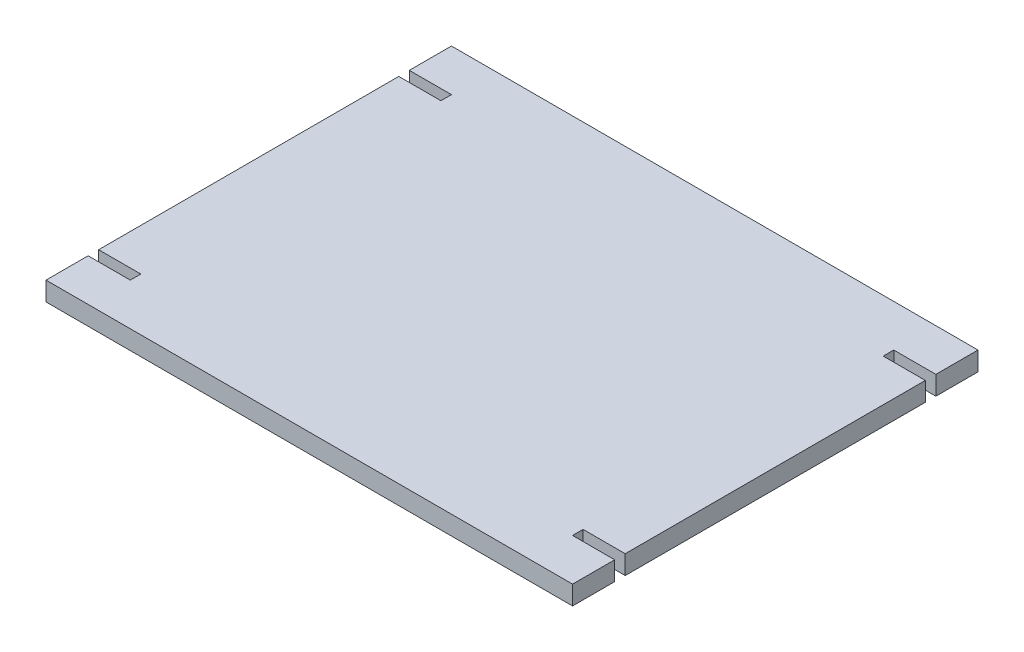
from build123d import *

# Parameters (mm, degrees)
BOSS_EXTRUDE1_DEPTH = 18


with BuildPart() as part:
    # Sketch1 → Boss-Extrude1 (new body)
    with BuildSketch(Plane(origin=(0, 0, 0), x_dir=(1, 0, 0), z_dir=(0, 1, 0))):
        Polygon((-301.875, 204.0625), (198.125, 204.0625), (198.125, 164.0625), (158.125, 164.0625), (158.125, 154.0625), (198.125, 154.0625), (198.125, -130.9375), (158.125, -130.9375), (158.125, -140.9375), (198.125, -140.9375), (198.125, -180.9375), (-301.875, -180.9375), (-301.875, -140.9375), (-261.875, -140.9375), (-261.875, -130.9375), (-301.875, -130.9375), (-301.875, 154.0625), (-261.875, 154.0625), (-261.875, 164.0625), (-301.875, 164.0625), align=None)
    extrude(amount=BOSS_EXTRUDE1_DEPTH)


solid = part.part
